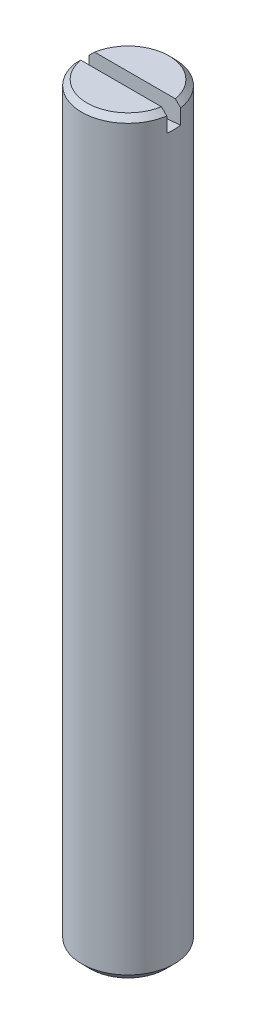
ISO-10303-21;
HEADER;
FILE_DESCRIPTION(('STEP AP214'),'2;1');
FILE_NAME('part.step','',(''),(''),'','','');
FILE_SCHEMA(('AUTOMOTIVE_DESIGN { 1 0 10303 214 1 1 1 1 }'));
ENDSEC;
DATA;
#1=APPLICATION_CONTEXT('core data for automotive mechanical design processes');
#2=APPLICATION_PROTOCOL_DEFINITION('international standard','automotive_design',2000,#1);
#3=PRODUCT_CONTEXT('',#1,'mechanical');
#4=PRODUCT('Part','Part','',(#3));
#5=PRODUCT_RELATED_PRODUCT_CATEGORY('part','',(#4));
#6=PRODUCT_DEFINITION_FORMATION('','',#4);
#7=PRODUCT_DEFINITION_CONTEXT('part definition',#1,'design');
#8=PRODUCT_DEFINITION('design','',#6,#7);
#9=PRODUCT_DEFINITION_SHAPE('','',#8);
#10=(LENGTH_UNIT() NAMED_UNIT(*) SI_UNIT(.MILLI.,.METRE.));
#11=(NAMED_UNIT(*) PLANE_ANGLE_UNIT() SI_UNIT($,.RADIAN.));
#12=(NAMED_UNIT(*) SI_UNIT($,.STERADIAN.) SOLID_ANGLE_UNIT());
#13=UNCERTAINTY_MEASURE_WITH_UNIT(LENGTH_MEASURE(1.E-05),#10,'distance_accuracy_value','');
#14=(GEOMETRIC_REPRESENTATION_CONTEXT(3) GLOBAL_UNCERTAINTY_ASSIGNED_CONTEXT((#13)) GLOBAL_UNIT_ASSIGNED_CONTEXT((#10,
#11,#12)) REPRESENTATION_CONTEXT('',''));
#15=CARTESIAN_POINT('',(0.,0.,0.));
#16=DIRECTION('',(0.,0.,1.));
#17=DIRECTION('',(1.,0.,0.));
#18=AXIS2_PLACEMENT_3D('',#15,#16,#17);
#19=CARTESIAN_POINT('',(0.,50.,0.));
#20=DIRECTION('',(0.,-1.,0.));
#21=DIRECTION('',(0.,0.,-1.));
#22=AXIS2_PLACEMENT_3D('',#19,#20,#21);
#23=PLANE('',#22);
#24=CARTESIAN_POINT('',(0.,50.0000000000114,0.));
#25=DIRECTION('',(0.,-1.,0.));
#26=DIRECTION('',(0.,0.,-1.));
#27=AXIS2_PLACEMENT_3D('',#24,#25,#26);
#28=CIRCLE('',#27,3.53999999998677);
#29=CARTESIAN_POINT('',(-3.48878202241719,50.0000000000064,-0.6));
#30=VERTEX_POINT('',#29);
#31=CARTESIAN_POINT('',(3.48878202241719,50.0000000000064,-0.6));
#32=VERTEX_POINT('',#31);
#33=EDGE_CURVE('E87',#30,#32,#28,.T.);
#34=ORIENTED_EDGE('',*,*,#33,.F.);
#35=DIRECTION('',(1.,0.,0.));
#36=VECTOR('',#35,1.);
#37=CARTESIAN_POINT('',(0.,50.,-0.6));
#38=LINE('',#37,#36);
#39=EDGE_CURVE('E19',#32,#30,#38,.F.);
#40=ORIENTED_EDGE('',*,*,#39,.F.);
#41=EDGE_LOOP('',(#34,#40));
#42=FACE_BOUND('',#41,.T.);
#43=ADVANCED_FACE('F14',(#42),#23,.F.);
#44=CARTESIAN_POINT('',(0.,50.,0.));
#45=DIRECTION('',(0.,-1.,0.));
#46=DIRECTION('',(0.,0.,-1.));
#47=AXIS2_PLACEMENT_3D('',#44,#45,#46);
#48=PLANE('',#47);
#49=DIRECTION('',(1.,0.,0.));
#50=VECTOR('',#49,1.);
#51=CARTESIAN_POINT('',(0.,50.,0.6));
#52=LINE('',#51,#50);
#53=CARTESIAN_POINT('',(-3.48878202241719,50.0000000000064,0.6));
#54=VERTEX_POINT('',#53);
#55=CARTESIAN_POINT('',(3.48878202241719,50.0000000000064,0.6));
#56=VERTEX_POINT('',#55);
#57=EDGE_CURVE('E81',#54,#56,#52,.T.);
#58=ORIENTED_EDGE('',*,*,#57,.F.);
#59=CARTESIAN_POINT('',(0.,50.0000000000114,0.));
#60=DIRECTION('',(0.,-1.,0.));
#61=DIRECTION('',(0.,0.,-1.));
#62=AXIS2_PLACEMENT_3D('',#59,#60,#61);
#63=CIRCLE('',#62,3.53999999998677);
#64=EDGE_CURVE('E74',#56,#54,#63,.T.);
#65=ORIENTED_EDGE('',*,*,#64,.F.);
#66=EDGE_LOOP('',(#58,#65));
#67=FACE_BOUND('',#66,.T.);
#68=ADVANCED_FACE('F86',(#67),#48,.F.);
#69=CARTESIAN_POINT('',(0.,49.5399999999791,0.));
#70=DIRECTION('',(0.,-1.,0.));
#71=DIRECTION('',(0.,0.,-1.));
#72=AXIS2_PLACEMENT_3D('',#69,#70,#71);
#73=CONICAL_SURFACE('',#72,3.99999999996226,0.785398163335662);
#74=CARTESIAN_POINT('',(-3.48878202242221,50.0000000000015,-0.6));
#75=CARTESIAN_POINT('',(-3.56650335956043,49.9233951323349,-0.6));
#76=CARTESIAN_POINT('',(-3.64419419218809,49.8467593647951,-0.6));
#77=CARTESIAN_POINT('',(-3.79951484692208,49.6934260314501,-0.6));
#78=CARTESIAN_POINT('',(-3.87714466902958,49.6167284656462,-0.6));
#79=CARTESIAN_POINT('',(-3.9547439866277,49.5399999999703,-0.6));
#80=B_SPLINE_CURVE_WITH_KNOTS('',3,(#74,#75,#76,#77,#78,#79),.UNSPECIFIED.,.F.,.F.,(4,2,4),(0.,
0.327383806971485,0.654767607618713),.UNSPECIFIED.);
#81=CARTESIAN_POINT('',(-3.95474398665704,49.5399999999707,-0.6));
#82=VERTEX_POINT('',#81);
#83=EDGE_CURVE('E85',#30,#82,#80,.T.);
#84=ORIENTED_EDGE('',*,*,#83,.F.);
#85=ORIENTED_EDGE('',*,*,#33,.T.);
#86=CARTESIAN_POINT('',(3.95474398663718,49.5399999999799,-0.600000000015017));
#87=CARTESIAN_POINT('',(3.87714466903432,49.616728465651,-0.600000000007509));
#88=CARTESIAN_POINT('',(3.79951484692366,49.6934260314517,-0.600000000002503));
#89=CARTESIAN_POINT('',(3.64419419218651,49.8467593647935,-0.599999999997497));
#90=CARTESIAN_POINT('',(3.56650335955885,49.9233951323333,-0.599999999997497));
#91=CARTESIAN_POINT('',(3.48878202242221,50.0000000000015,-0.6));
#92=B_SPLINE_CURVE_WITH_KNOTS('',3,(#86,#87,#88,#89,#90,#91),.UNSPECIFIED.,.F.,.F.,(4,2,4),(0.,
0.327383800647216,0.654767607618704),.UNSPECIFIED.);
#93=CARTESIAN_POINT('',(3.95474398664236,49.5399999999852,-0.6));
#94=VERTEX_POINT('',#93);
#95=EDGE_CURVE('E112',#94,#32,#92,.T.);
#96=ORIENTED_EDGE('',*,*,#95,.F.);
#97=CARTESIAN_POINT('',(0.,49.54,0.));
#98=DIRECTION('',(0.,-1.,0.));
#99=DIRECTION('',(0.,0.,-1.));
#100=AXIS2_PLACEMENT_3D('',#97,#98,#99);
#101=CIRCLE('',#100,4.);
#102=EDGE_CURVE('E101',#82,#94,#101,.T.);
#103=ORIENTED_EDGE('',*,*,#102,.F.);
#104=EDGE_LOOP('',(#84,#85,#96,#103));
#105=FACE_BOUND('',#104,.T.);
#106=ADVANCED_FACE('F128',(#105),#73,.T.);
#107=CARTESIAN_POINT('',(0.,79.5,-0.6));
#108=DIRECTION('',(0.,0.,1.));
#109=DIRECTION('',(1.,0.,0.));
#110=AXIS2_PLACEMENT_3D('',#107,#108,#109);
#111=PLANE('',#110);
#112=ORIENTED_EDGE('',*,*,#39,.T.);
#113=ORIENTED_EDGE('',*,*,#83,.T.);
#114=DIRECTION('',(0.,1.,0.));
#115=VECTOR('',#114,1.);
#116=CARTESIAN_POINT('',(-3.95474398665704,79.5,-0.6));
#117=LINE('',#116,#115);
#118=CARTESIAN_POINT('',(-3.95474398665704,48.2492400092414,-0.6));
#119=VERTEX_POINT('',#118);
#120=EDGE_CURVE('E58',#82,#119,#117,.F.);
#121=ORIENTED_EDGE('',*,*,#120,.T.);
#122=CARTESIAN_POINT('',(0.,79.5,-0.6));
#123=DIRECTION('',(0.,0.,-1.));
#124=DIRECTION('',(-1.,0.,0.));
#125=AXIS2_PLACEMENT_3D('',#122,#123,#124);
#126=CIRCLE('',#125,31.5);
#127=CARTESIAN_POINT('',(3.95474398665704,48.2492400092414,-0.6));
#128=VERTEX_POINT('',#127);
#129=EDGE_CURVE('E109',#119,#128,#126,.F.);
#130=ORIENTED_EDGE('',*,*,#129,.T.);
#131=DIRECTION('',(0.,1.,0.));
#132=VECTOR('',#131,1.);
#133=CARTESIAN_POINT('',(3.95474398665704,79.5,-0.6));
#134=LINE('',#133,#132);
#135=EDGE_CURVE('E110',#128,#94,#134,.T.);
#136=ORIENTED_EDGE('',*,*,#135,.T.);
#137=ORIENTED_EDGE('',*,*,#95,.T.);
#138=EDGE_LOOP('',(#112,#113,#121,#130,#136,#137));
#139=FACE_BOUND('',#138,.T.);
#140=ADVANCED_FACE('F124',(#139),#111,.T.);
#141=CARTESIAN_POINT('',(0.,49.5399999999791,0.));
#142=DIRECTION('',(0.,-1.,0.));
#143=DIRECTION('',(0.,0.,-1.));
#144=AXIS2_PLACEMENT_3D('',#141,#142,#143);
#145=CONICAL_SURFACE('',#144,3.99999999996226,0.785398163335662);
#146=ORIENTED_EDGE('',*,*,#64,.T.);
#147=CARTESIAN_POINT('',(-3.48878202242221,50.0000000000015,0.6));
#148=CARTESIAN_POINT('',(-3.56650335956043,49.9233951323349,0.6));
#149=CARTESIAN_POINT('',(-3.64419419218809,49.8467593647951,0.6));
#150=CARTESIAN_POINT('',(-3.79951484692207,49.6934260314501,0.6));
#151=CARTESIAN_POINT('',(-3.87714466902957,49.6167284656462,0.6));
#152=CARTESIAN_POINT('',(-3.95474398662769,49.5399999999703,0.6));
#153=B_SPLINE_CURVE_WITH_KNOTS('',3,(#147,#148,#149,#150,#151,#152),.UNSPECIFIED.,.F.,.F.,(4,2,
4),(0.,0.327383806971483,0.654767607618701),.UNSPECIFIED.);
#154=CARTESIAN_POINT('',(-3.95474398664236,49.5399999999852,0.6));
#155=VERTEX_POINT('',#154);
#156=EDGE_CURVE('E34',#54,#155,#153,.T.);
#157=ORIENTED_EDGE('',*,*,#156,.T.);
#158=CARTESIAN_POINT('',(0.,49.54,0.));
#159=DIRECTION('',(0.,-1.,0.));
#160=DIRECTION('',(0.,0.,-1.));
#161=AXIS2_PLACEMENT_3D('',#158,#159,#160);
#162=CIRCLE('',#161,4.);
#163=CARTESIAN_POINT('',(3.95474398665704,49.5399999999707,0.6));
#164=VERTEX_POINT('',#163);
#165=EDGE_CURVE('E75',#164,#155,#162,.T.);
#166=ORIENTED_EDGE('',*,*,#165,.F.);
#167=CARTESIAN_POINT('',(3.95474398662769,49.5399999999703,0.6));
#168=CARTESIAN_POINT('',(3.87714466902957,49.6167284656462,0.6));
#169=CARTESIAN_POINT('',(3.79951484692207,49.6934260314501,0.6));
#170=CARTESIAN_POINT('',(3.64419419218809,49.8467593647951,0.6));
#171=CARTESIAN_POINT('',(3.56650335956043,49.9233951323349,0.6));
#172=CARTESIAN_POINT('',(3.48878202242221,50.0000000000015,0.6));
#173=B_SPLINE_CURVE_WITH_KNOTS('',3,(#167,#168,#169,#170,#171,#172),.UNSPECIFIED.,.F.,.F.,(4,2,
4),(0.,0.327383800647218,0.654767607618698),.UNSPECIFIED.);
#174=EDGE_CURVE('E70',#164,#56,#173,.T.);
#175=ORIENTED_EDGE('',*,*,#174,.T.);
#176=EDGE_LOOP('',(#146,#157,#166,#175));
#177=FACE_BOUND('',#176,.T.);
#178=ADVANCED_FACE('F72',(#177),#145,.T.);
#179=CARTESIAN_POINT('',(0.,79.5,0.6));
#180=DIRECTION('',(0.,0.,1.));
#181=DIRECTION('',(1.,0.,0.));
#182=AXIS2_PLACEMENT_3D('',#179,#180,#181);
#183=PLANE('',#182);
#184=ORIENTED_EDGE('',*,*,#57,.T.);
#185=ORIENTED_EDGE('',*,*,#174,.F.);
#186=DIRECTION('',(0.,1.,0.));
#187=VECTOR('',#186,1.);
#188=CARTESIAN_POINT('',(3.95474398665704,79.5,0.6));
#189=LINE('',#188,#187);
#190=CARTESIAN_POINT('',(3.95474398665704,48.2492400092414,0.6));
#191=VERTEX_POINT('',#190);
#192=EDGE_CURVE('E78',#191,#164,#189,.T.);
#193=ORIENTED_EDGE('',*,*,#192,.F.);
#194=CARTESIAN_POINT('',(0.,79.5,0.6));
#195=DIRECTION('',(0.,0.,-1.));
#196=DIRECTION('',(-1.,0.,0.));
#197=AXIS2_PLACEMENT_3D('',#194,#195,#196);
#198=CIRCLE('',#197,31.5);
#199=CARTESIAN_POINT('',(-3.95474398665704,48.2492400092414,0.6));
#200=VERTEX_POINT('',#199);
#201=EDGE_CURVE('E106',#200,#191,#198,.F.);
#202=ORIENTED_EDGE('',*,*,#201,.F.);
#203=DIRECTION('',(0.,1.,0.));
#204=VECTOR('',#203,1.);
#205=CARTESIAN_POINT('',(-3.95474398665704,79.5,0.6));
#206=LINE('',#205,#204);
#207=EDGE_CURVE('E104',#155,#200,#206,.F.);
#208=ORIENTED_EDGE('',*,*,#207,.F.);
#209=ORIENTED_EDGE('',*,*,#156,.F.);
#210=EDGE_LOOP('',(#184,#185,#193,#202,#208,#209));
#211=FACE_BOUND('',#210,.T.);
#212=ADVANCED_FACE('F82',(#211),#183,.F.);
#213=CARTESIAN_POINT('',(0.,79.5,0.6));
#214=DIRECTION('',(0.,0.,-1.));
#215=DIRECTION('',(-1.,0.,0.));
#216=AXIS2_PLACEMENT_3D('',#213,#214,#215);
#217=CYLINDRICAL_SURFACE('',#216,31.5);
#218=CARTESIAN_POINT('',(3.95474398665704,48.2492400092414,-0.6));
#219=CARTESIAN_POINT('',(3.96984984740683,48.2511544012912,-0.500484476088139));
#220=CARTESIAN_POINT('',(3.98118553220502,48.2525972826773,-0.40038868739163));
#221=CARTESIAN_POINT('',(3.9962389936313,48.2545175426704,-0.20019306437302));
#222=CARTESIAN_POINT('',(4.,48.2550004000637,-0.10009653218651));
#223=CARTESIAN_POINT('',(4.,48.2550004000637,0.10009653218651));
#224=CARTESIAN_POINT('',(3.9962389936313,48.2545175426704,0.20019306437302));
#225=CARTESIAN_POINT('',(3.98118553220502,48.2525972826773,0.40038868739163));
#226=CARTESIAN_POINT('',(3.96984984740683,48.2511544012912,0.500484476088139));
#227=CARTESIAN_POINT('',(3.95474398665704,48.2492400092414,0.6));
#228=B_SPLINE_CURVE_WITH_KNOTS('',3,(#218,#219,#220,#221,#222,#223,#224,#225,#226,#227),
.UNSPECIFIED.,.F.,.F.,(4,2,2,2,4),(0.,0.301946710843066,0.602165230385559,0.902383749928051,
1.20433046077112),.UNSPECIFIED.);
#229=EDGE_CURVE('E25',#128,#191,#228,.T.);
#230=ORIENTED_EDGE('',*,*,#229,.F.);
#231=ORIENTED_EDGE('',*,*,#129,.F.);
#232=CARTESIAN_POINT('',(-3.95474398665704,48.2492400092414,0.6));
#233=CARTESIAN_POINT('',(-3.96984984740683,48.2511544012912,0.500484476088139));
#234=CARTESIAN_POINT('',(-3.98118553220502,48.2525972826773,0.40038868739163));
#235=CARTESIAN_POINT('',(-3.9962389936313,48.2545175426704,0.20019306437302));
#236=CARTESIAN_POINT('',(-4.,48.2550004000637,0.10009653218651));
#237=CARTESIAN_POINT('',(-4.,48.2550004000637,-0.10009653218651));
#238=CARTESIAN_POINT('',(-3.9962389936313,48.2545175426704,-0.20019306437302));
#239=CARTESIAN_POINT('',(-3.98118553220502,48.2525972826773,-0.40038868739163));
#240=CARTESIAN_POINT('',(-3.96984984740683,48.2511544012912,-0.500484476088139));
#241=CARTESIAN_POINT('',(-3.95474398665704,48.2492400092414,-0.6));
#242=B_SPLINE_CURVE_WITH_KNOTS('',3,(#232,#233,#234,#235,#236,#237,#238,#239,#240,#241),
.UNSPECIFIED.,.F.,.F.,(4,2,2,2,4),(0.,0.301946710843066,0.602165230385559,0.902383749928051,
1.20433046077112),.UNSPECIFIED.);
#243=EDGE_CURVE('E9',#200,#119,#242,.T.);
#244=ORIENTED_EDGE('',*,*,#243,.F.);
#245=ORIENTED_EDGE('',*,*,#201,.T.);
#246=EDGE_LOOP('',(#230,#231,#244,#245));
#247=FACE_BOUND('',#246,.T.);
#248=ADVANCED_FACE('F151',(#247),#217,.F.);
#249=CARTESIAN_POINT('',(0.,37.5,0.));
#250=DIRECTION('',(0.,-1.,0.));
#251=DIRECTION('',(0.,0.,-1.));
#252=AXIS2_PLACEMENT_3D('',#249,#250,#251);
#253=CYLINDRICAL_SURFACE('',#252,4.);
#254=ORIENTED_EDGE('',*,*,#229,.T.);
#255=ORIENTED_EDGE('',*,*,#192,.T.);
#256=ORIENTED_EDGE('',*,*,#165,.T.);
#257=ORIENTED_EDGE('',*,*,#207,.T.);
#258=ORIENTED_EDGE('',*,*,#243,.T.);
#259=ORIENTED_EDGE('',*,*,#120,.F.);
#260=ORIENTED_EDGE('',*,*,#102,.T.);
#261=ORIENTED_EDGE('',*,*,#135,.F.);
#262=EDGE_LOOP('',(#254,#255,#256,#257,#258,#259,#260,#261));
#263=FACE_BOUND('',#262,.T.);
#264=CARTESIAN_POINT('',(0.,-14.233,0.));
#265=DIRECTION('',(0.,-1.,0.));
#266=DIRECTION('',(0.,0.,-1.));
#267=AXIS2_PLACEMENT_3D('',#264,#265,#266);
#268=CIRCLE('',#267,4.);
#269=CARTESIAN_POINT('',(0.,-14.233,-4.));
#270=VERTEX_POINT('',#269);
#271=EDGE_CURVE('E103',#270,#270,#268,.T.);
#272=ORIENTED_EDGE('',*,*,#271,.F.);
#273=EDGE_LOOP('',(#272));
#274=FACE_BOUND('',#273,.T.);
#275=ADVANCED_FACE('F16',(#263,#274),#253,.T.);
#276=CARTESIAN_POINT('',(3.233,-15.,0.));
#277=DIRECTION('',(0.,1.,0.));
#278=DIRECTION('',(0.,0.,1.));
#279=AXIS2_PLACEMENT_3D('',#276,#277,#278);
#280=PLANE('',#279);
#281=CARTESIAN_POINT('',(0.,-15.,0.));
#282=DIRECTION('',(0.,1.,0.));
#283=DIRECTION('',(-1.,0.,0.));
#284=AXIS2_PLACEMENT_3D('',#281,#282,#283);
#285=CIRCLE('',#284,3.23299999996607);
#286=CARTESIAN_POINT('',(-3.23299999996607,-15.,0.));
#287=VERTEX_POINT('',#286);
#288=EDGE_CURVE('E171',#287,#287,#285,.T.);
#289=ORIENTED_EDGE('',*,*,#288,.F.);
#290=EDGE_LOOP('',(#289));
#291=FACE_BOUND('',#290,.T.);
#292=ADVANCED_FACE('F157',(#291),#280,.F.);
#293=CARTESIAN_POINT('',(0.,-14.232999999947,0.));
#294=DIRECTION('',(0.,1.,0.));
#295=DIRECTION('',(-1.,0.,0.));
#296=AXIS2_PLACEMENT_3D('',#293,#294,#295);
#297=CONICAL_SURFACE('',#296,4.0000000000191,0.785398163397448);
#298=ORIENTED_EDGE('',*,*,#271,.T.);
#299=EDGE_LOOP('',(#298));
#300=FACE_BOUND('',#299,.T.);
#301=ORIENTED_EDGE('',*,*,#288,.T.);
#302=EDGE_LOOP('',(#301));
#303=FACE_BOUND('',#302,.T.);
#304=ADVANCED_FACE('F177',(#300,#303),#297,.T.);
#305=CLOSED_SHELL('',(#43,#68,#106,#140,#178,#212,#248,#275,#292,#304));
#306=MANIFOLD_SOLID_BREP('B1',#305);
#307=ADVANCED_BREP_SHAPE_REPRESENTATION('',(#18,#306),#14);
#308=SHAPE_DEFINITION_REPRESENTATION(#9,#307);
ENDSEC;
END-ISO-10303-21;
